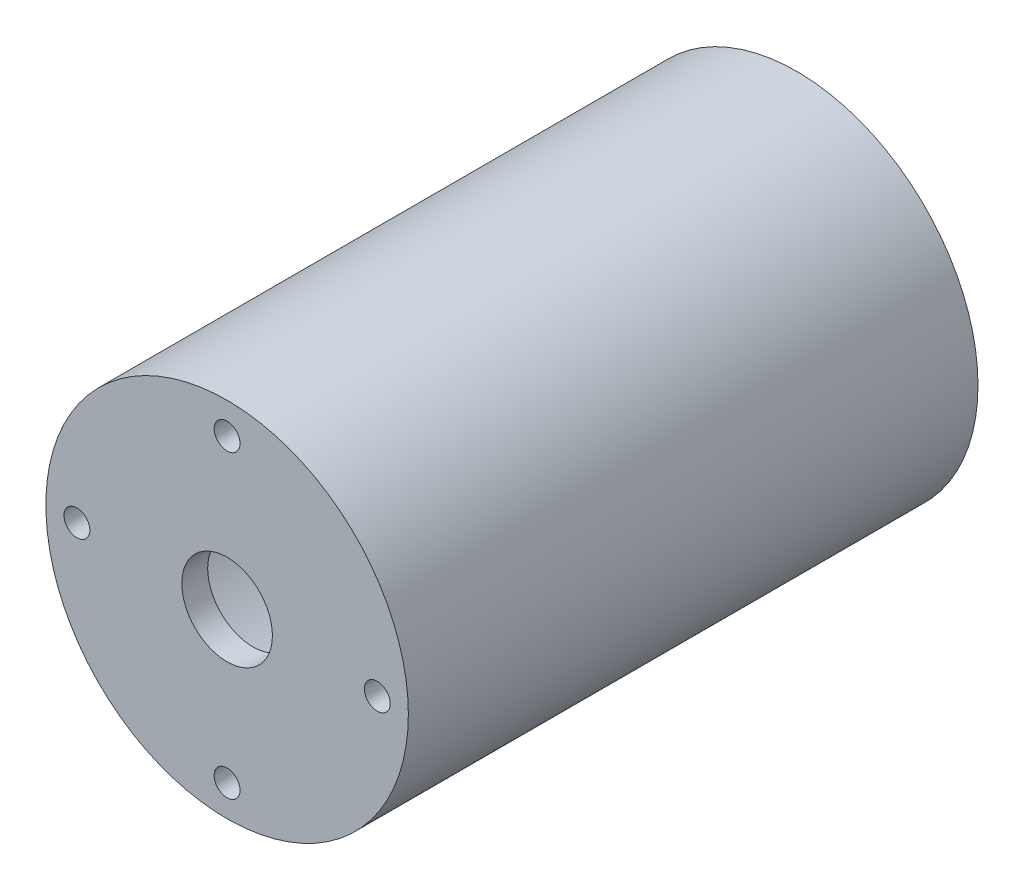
ISO-10303-21;
HEADER;
FILE_DESCRIPTION(('STEP AP214'),'2;1');
FILE_NAME('part.step','',(''),(''),'','','');
FILE_SCHEMA(('AUTOMOTIVE_DESIGN { 1 0 10303 214 1 1 1 1 }'));
ENDSEC;
DATA;
#1=APPLICATION_CONTEXT('core data for automotive mechanical design processes');
#2=APPLICATION_PROTOCOL_DEFINITION('international standard','automotive_design',2000,#1);
#3=PRODUCT_CONTEXT('',#1,'mechanical');
#4=PRODUCT('Part','Part','',(#3));
#5=PRODUCT_RELATED_PRODUCT_CATEGORY('part','',(#4));
#6=PRODUCT_DEFINITION_FORMATION('','',#4);
#7=PRODUCT_DEFINITION_CONTEXT('part definition',#1,'design');
#8=PRODUCT_DEFINITION('design','',#6,#7);
#9=PRODUCT_DEFINITION_SHAPE('','',#8);
#10=(LENGTH_UNIT() NAMED_UNIT(*) SI_UNIT(.MILLI.,.METRE.));
#11=(NAMED_UNIT(*) PLANE_ANGLE_UNIT() SI_UNIT($,.RADIAN.));
#12=(NAMED_UNIT(*) SI_UNIT($,.STERADIAN.) SOLID_ANGLE_UNIT());
#13=UNCERTAINTY_MEASURE_WITH_UNIT(LENGTH_MEASURE(1.E-05),#10,'distance_accuracy_value','');
#14=(GEOMETRIC_REPRESENTATION_CONTEXT(3) GLOBAL_UNCERTAINTY_ASSIGNED_CONTEXT((#13)) GLOBAL_UNIT_ASSIGNED_CONTEXT((#10,
#11,#12)) REPRESENTATION_CONTEXT('',''));
#15=CARTESIAN_POINT('',(0.,0.,0.));
#16=DIRECTION('',(0.,0.,1.));
#17=DIRECTION('',(1.,0.,0.));
#18=AXIS2_PLACEMENT_3D('',#15,#16,#17);
#19=CARTESIAN_POINT('',(0.,0.,220.));
#20=DIRECTION('',(0.,0.,-1.));
#21=DIRECTION('',(-1.,0.,0.));
#22=AXIS2_PLACEMENT_3D('',#19,#20,#21);
#23=CYLINDRICAL_SURFACE('',#22,70.);
#24=CARTESIAN_POINT('',(0.,0.,220.));
#25=DIRECTION('',(0.,0.,1.));
#26=DIRECTION('',(1.,0.,0.));
#27=AXIS2_PLACEMENT_3D('',#24,#25,#26);
#28=CIRCLE('',#27,70.);
#29=CARTESIAN_POINT('',(70.,0.,220.));
#30=VERTEX_POINT('',#29);
#31=EDGE_CURVE('E10',#30,#30,#28,.T.);
#32=ORIENTED_EDGE('',*,*,#31,.F.);
#33=EDGE_LOOP('',(#32));
#34=FACE_BOUND('',#33,.T.);
#35=CARTESIAN_POINT('',(0.,0.,0.));
#36=DIRECTION('',(0.,0.,1.));
#37=DIRECTION('',(1.,0.,0.));
#38=AXIS2_PLACEMENT_3D('',#35,#36,#37);
#39=CIRCLE('',#38,70.);
#40=CARTESIAN_POINT('',(70.,0.,0.));
#41=VERTEX_POINT('',#40);
#42=EDGE_CURVE('E32',#41,#41,#39,.T.);
#43=ORIENTED_EDGE('',*,*,#42,.T.);
#44=EDGE_LOOP('',(#43));
#45=FACE_BOUND('',#44,.T.);
#46=ADVANCED_FACE('F29',(#34,#45),#23,.T.);
#47=CARTESIAN_POINT('',(0.,0.,220.));
#48=DIRECTION('',(0.,0.,1.));
#49=DIRECTION('',(1.,0.,0.));
#50=AXIS2_PLACEMENT_3D('',#47,#48,#49);
#51=PLANE('',#50);
#52=CARTESIAN_POINT('',(0.,0.,220.));
#53=DIRECTION('',(0.,0.,1.));
#54=DIRECTION('',(1.,0.,0.));
#55=AXIS2_PLACEMENT_3D('',#52,#53,#54);
#56=CIRCLE('',#55,17.5);
#57=CARTESIAN_POINT('',(17.5,0.,220.));
#58=VERTEX_POINT('',#57);
#59=EDGE_CURVE('E68',#58,#58,#56,.T.);
#60=ORIENTED_EDGE('',*,*,#59,.F.);
#61=EDGE_LOOP('',(#60));
#62=FACE_BOUND('',#61,.T.);
#63=CARTESIAN_POINT('',(-58.,0.,220.));
#64=DIRECTION('',(0.,0.,1.));
#65=DIRECTION('',(1.,0.,0.));
#66=AXIS2_PLACEMENT_3D('',#63,#64,#65);
#67=CIRCLE('',#66,5.);
#68=CARTESIAN_POINT('',(-53.,0.,220.));
#69=VERTEX_POINT('',#68);
#70=EDGE_CURVE('E62',#69,#69,#67,.T.);
#71=ORIENTED_EDGE('',*,*,#70,.F.);
#72=EDGE_LOOP('',(#71));
#73=FACE_BOUND('',#72,.T.);
#74=CARTESIAN_POINT('',(0.,-58.,220.));
#75=DIRECTION('',(0.,0.,1.));
#76=DIRECTION('',(1.,0.,0.));
#77=AXIS2_PLACEMENT_3D('',#74,#75,#76);
#78=CIRCLE('',#77,5.);
#79=CARTESIAN_POINT('',(5.00000000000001,-58.,220.));
#80=VERTEX_POINT('',#79);
#81=EDGE_CURVE('E56',#80,#80,#78,.T.);
#82=ORIENTED_EDGE('',*,*,#81,.F.);
#83=EDGE_LOOP('',(#82));
#84=FACE_BOUND('',#83,.T.);
#85=CARTESIAN_POINT('',(58.,0.,220.));
#86=DIRECTION('',(0.,0.,1.));
#87=DIRECTION('',(1.,0.,0.));
#88=AXIS2_PLACEMENT_3D('',#85,#86,#87);
#89=CIRCLE('',#88,5.);
#90=CARTESIAN_POINT('',(63.,0.,220.));
#91=VERTEX_POINT('',#90);
#92=EDGE_CURVE('E50',#91,#91,#89,.T.);
#93=ORIENTED_EDGE('',*,*,#92,.F.);
#94=EDGE_LOOP('',(#93));
#95=FACE_BOUND('',#94,.T.);
#96=CARTESIAN_POINT('',(0.,58.,220.));
#97=DIRECTION('',(0.,0.,1.));
#98=DIRECTION('',(1.,0.,0.));
#99=AXIS2_PLACEMENT_3D('',#96,#97,#98);
#100=CIRCLE('',#99,5.);
#101=CARTESIAN_POINT('',(5.,58.,220.));
#102=VERTEX_POINT('',#101);
#103=EDGE_CURVE('E44',#102,#102,#100,.T.);
#104=ORIENTED_EDGE('',*,*,#103,.F.);
#105=EDGE_LOOP('',(#104));
#106=FACE_BOUND('',#105,.T.);
#107=ORIENTED_EDGE('',*,*,#31,.T.);
#108=EDGE_LOOP('',(#107));
#109=FACE_BOUND('',#108,.T.);
#110=ADVANCED_FACE('F79',(#62,#73,#84,#95,#106,#109),#51,.T.);
#111=CARTESIAN_POINT('',(0.,0.,0.));
#112=DIRECTION('',(0.,0.,1.));
#113=DIRECTION('',(1.,0.,0.));
#114=AXIS2_PLACEMENT_3D('',#111,#112,#113);
#115=PLANE('',#114);
#116=CARTESIAN_POINT('',(0.,0.,0.));
#117=DIRECTION('',(0.,0.,-1.));
#118=DIRECTION('',(-1.,0.,0.));
#119=AXIS2_PLACEMENT_3D('',#116,#117,#118);
#120=CIRCLE('',#119,65.);
#121=CARTESIAN_POINT('',(-65.,0.,0.));
#122=VERTEX_POINT('',#121);
#123=EDGE_CURVE('E41',#122,#122,#120,.T.);
#124=ORIENTED_EDGE('',*,*,#123,.F.);
#125=EDGE_LOOP('',(#124));
#126=FACE_BOUND('',#125,.T.);
#127=ORIENTED_EDGE('',*,*,#42,.F.);
#128=EDGE_LOOP('',(#127));
#129=FACE_BOUND('',#128,.T.);
#130=ADVANCED_FACE('F82',(#126,#129),#115,.F.);
#131=CARTESIAN_POINT('',(0.,0.,210.));
#132=DIRECTION('',(0.,0.,-1.));
#133=DIRECTION('',(-1.,0.,0.));
#134=AXIS2_PLACEMENT_3D('',#131,#132,#133);
#135=CYLINDRICAL_SURFACE('',#134,65.);
#136=CARTESIAN_POINT('',(0.,0.,210.));
#137=DIRECTION('',(0.,0.,-1.));
#138=DIRECTION('',(-1.,0.,0.));
#139=AXIS2_PLACEMENT_3D('',#136,#137,#138);
#140=CIRCLE('',#139,65.);
#141=CARTESIAN_POINT('',(-65.,0.,210.));
#142=VERTEX_POINT('',#141);
#143=EDGE_CURVE('E39',#142,#142,#140,.T.);
#144=ORIENTED_EDGE('',*,*,#143,.F.);
#145=EDGE_LOOP('',(#144));
#146=FACE_BOUND('',#145,.T.);
#147=ORIENTED_EDGE('',*,*,#123,.T.);
#148=EDGE_LOOP('',(#147));
#149=FACE_BOUND('',#148,.T.);
#150=ADVANCED_FACE('F105',(#146,#149),#135,.F.);
#151=CARTESIAN_POINT('',(0.,0.,210.));
#152=DIRECTION('',(0.,0.,-1.));
#153=DIRECTION('',(-1.,0.,0.));
#154=AXIS2_PLACEMENT_3D('',#151,#152,#153);
#155=PLANE('',#154);
#156=CARTESIAN_POINT('',(0.,0.,210.));
#157=DIRECTION('',(0.,0.,-1.));
#158=DIRECTION('',(-1.,0.,0.));
#159=AXIS2_PLACEMENT_3D('',#156,#157,#158);
#160=CIRCLE('',#159,17.5);
#161=CARTESIAN_POINT('',(-17.5,0.,210.));
#162=VERTEX_POINT('',#161);
#163=EDGE_CURVE('E71',#162,#162,#160,.F.);
#164=ORIENTED_EDGE('',*,*,#163,.T.);
#165=EDGE_LOOP('',(#164));
#166=FACE_BOUND('',#165,.T.);
#167=CARTESIAN_POINT('',(-58.,0.,210.));
#168=DIRECTION('',(0.,0.,-1.));
#169=DIRECTION('',(-1.,0.,0.));
#170=AXIS2_PLACEMENT_3D('',#167,#168,#169);
#171=CIRCLE('',#170,5.);
#172=CARTESIAN_POINT('',(-63.,0.,210.));
#173=VERTEX_POINT('',#172);
#174=EDGE_CURVE('E65',#173,#173,#171,.F.);
#175=ORIENTED_EDGE('',*,*,#174,.T.);
#176=EDGE_LOOP('',(#175));
#177=FACE_BOUND('',#176,.T.);
#178=CARTESIAN_POINT('',(0.,-58.,210.));
#179=DIRECTION('',(0.,0.,-1.));
#180=DIRECTION('',(-1.,0.,0.));
#181=AXIS2_PLACEMENT_3D('',#178,#179,#180);
#182=CIRCLE('',#181,5.);
#183=CARTESIAN_POINT('',(-4.99999999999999,-58.,210.));
#184=VERTEX_POINT('',#183);
#185=EDGE_CURVE('E59',#184,#184,#182,.F.);
#186=ORIENTED_EDGE('',*,*,#185,.T.);
#187=EDGE_LOOP('',(#186));
#188=FACE_BOUND('',#187,.T.);
#189=CARTESIAN_POINT('',(58.,0.,210.));
#190=DIRECTION('',(0.,0.,-1.));
#191=DIRECTION('',(-1.,0.,0.));
#192=AXIS2_PLACEMENT_3D('',#189,#190,#191);
#193=CIRCLE('',#192,5.);
#194=CARTESIAN_POINT('',(53.,0.,210.));
#195=VERTEX_POINT('',#194);
#196=EDGE_CURVE('E53',#195,#195,#193,.F.);
#197=ORIENTED_EDGE('',*,*,#196,.T.);
#198=EDGE_LOOP('',(#197));
#199=FACE_BOUND('',#198,.T.);
#200=CARTESIAN_POINT('',(0.,58.,210.));
#201=DIRECTION('',(0.,0.,-1.));
#202=DIRECTION('',(-1.,0.,0.));
#203=AXIS2_PLACEMENT_3D('',#200,#201,#202);
#204=CIRCLE('',#203,5.);
#205=CARTESIAN_POINT('',(-5.,58.,210.));
#206=VERTEX_POINT('',#205);
#207=EDGE_CURVE('E47',#206,#206,#204,.F.);
#208=ORIENTED_EDGE('',*,*,#207,.T.);
#209=EDGE_LOOP('',(#208));
#210=FACE_BOUND('',#209,.T.);
#211=ORIENTED_EDGE('',*,*,#143,.T.);
#212=EDGE_LOOP('',(#211));
#213=FACE_BOUND('',#212,.T.);
#214=ADVANCED_FACE('F95',(#166,#177,#188,#199,#210,#213),#155,.T.);
#215=CARTESIAN_POINT('',(0.,58.,-0.001000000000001));
#216=DIRECTION('',(0.,0.,1.));
#217=DIRECTION('',(1.,0.,0.));
#218=AXIS2_PLACEMENT_3D('',#215,#216,#217);
#219=CYLINDRICAL_SURFACE('',#218,5.);
#220=ORIENTED_EDGE('',*,*,#207,.F.);
#221=EDGE_LOOP('',(#220));
#222=FACE_BOUND('',#221,.T.);
#223=ORIENTED_EDGE('',*,*,#103,.T.);
#224=EDGE_LOOP('',(#223));
#225=FACE_BOUND('',#224,.T.);
#226=ADVANCED_FACE('F92',(#222,#225),#219,.F.);
#227=CARTESIAN_POINT('',(58.,0.,-0.001000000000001));
#228=DIRECTION('',(0.,0.,1.));
#229=DIRECTION('',(1.,0.,0.));
#230=AXIS2_PLACEMENT_3D('',#227,#228,#229);
#231=CYLINDRICAL_SURFACE('',#230,5.);
#232=ORIENTED_EDGE('',*,*,#196,.F.);
#233=EDGE_LOOP('',(#232));
#234=FACE_BOUND('',#233,.T.);
#235=ORIENTED_EDGE('',*,*,#92,.T.);
#236=EDGE_LOOP('',(#235));
#237=FACE_BOUND('',#236,.T.);
#238=ADVANCED_FACE('F94',(#234,#237),#231,.F.);
#239=CARTESIAN_POINT('',(0.,-58.,-0.001000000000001));
#240=DIRECTION('',(0.,0.,1.));
#241=DIRECTION('',(1.,0.,0.));
#242=AXIS2_PLACEMENT_3D('',#239,#240,#241);
#243=CYLINDRICAL_SURFACE('',#242,5.);
#244=ORIENTED_EDGE('',*,*,#185,.F.);
#245=EDGE_LOOP('',(#244));
#246=FACE_BOUND('',#245,.T.);
#247=ORIENTED_EDGE('',*,*,#81,.T.);
#248=EDGE_LOOP('',(#247));
#249=FACE_BOUND('',#248,.T.);
#250=ADVANCED_FACE('F102',(#246,#249),#243,.F.);
#251=CARTESIAN_POINT('',(-58.,0.,-0.001000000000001));
#252=DIRECTION('',(0.,0.,1.));
#253=DIRECTION('',(1.,0.,0.));
#254=AXIS2_PLACEMENT_3D('',#251,#252,#253);
#255=CYLINDRICAL_SURFACE('',#254,5.);
#256=ORIENTED_EDGE('',*,*,#174,.F.);
#257=EDGE_LOOP('',(#256));
#258=FACE_BOUND('',#257,.T.);
#259=ORIENTED_EDGE('',*,*,#70,.T.);
#260=EDGE_LOOP('',(#259));
#261=FACE_BOUND('',#260,.T.);
#262=ADVANCED_FACE('F146',(#258,#261),#255,.F.);
#263=CARTESIAN_POINT('',(0.,0.,-0.001000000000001));
#264=DIRECTION('',(0.,0.,1.));
#265=DIRECTION('',(1.,0.,0.));
#266=AXIS2_PLACEMENT_3D('',#263,#264,#265);
#267=CYLINDRICAL_SURFACE('',#266,17.5);
#268=ORIENTED_EDGE('',*,*,#163,.F.);
#269=EDGE_LOOP('',(#268));
#270=FACE_BOUND('',#269,.T.);
#271=ORIENTED_EDGE('',*,*,#59,.T.);
#272=EDGE_LOOP('',(#271));
#273=FACE_BOUND('',#272,.T.);
#274=ADVANCED_FACE('F77',(#270,#273),#267,.F.);
#275=CLOSED_SHELL('',(#46,#110,#130,#150,#214,#226,#238,#250,#262,#274));
#276=MANIFOLD_SOLID_BREP('B2',#275);
#277=ADVANCED_BREP_SHAPE_REPRESENTATION('',(#18,#276),#14);
#278=SHAPE_DEFINITION_REPRESENTATION(#9,#277);
ENDSEC;
END-ISO-10303-21;
